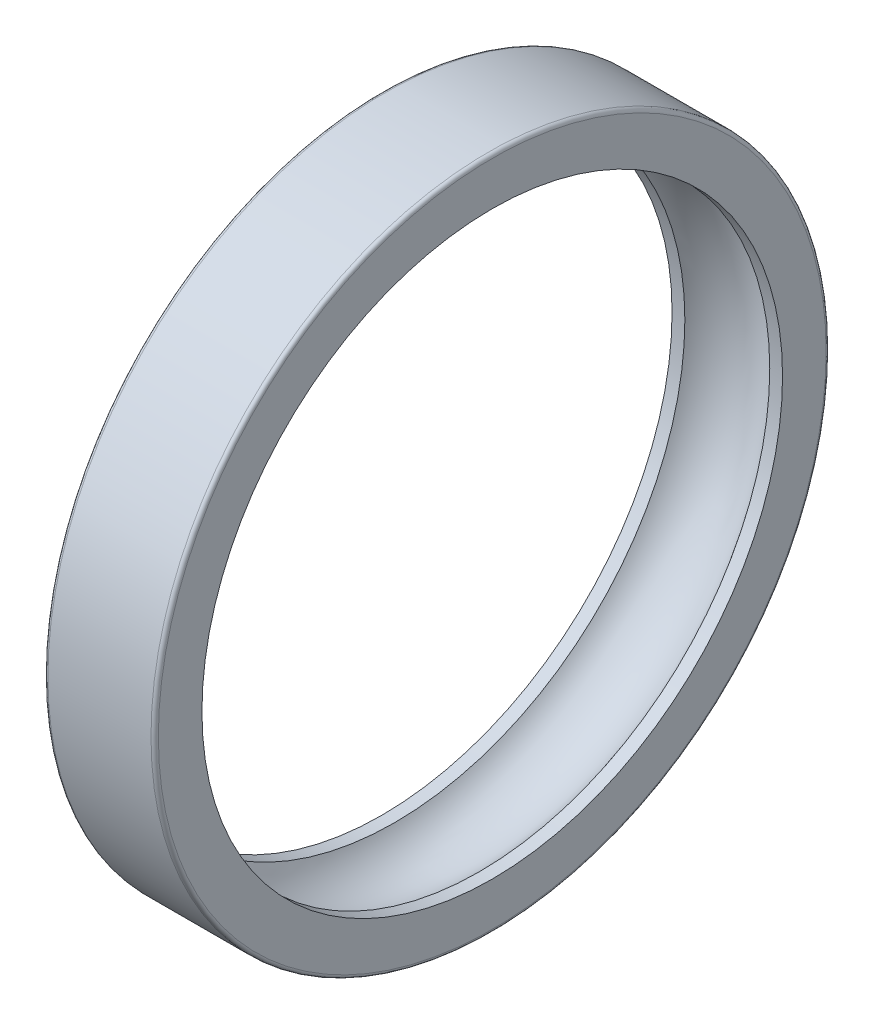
ISO-10303-21;
HEADER;
FILE_DESCRIPTION(('STEP AP214'),'2;1');
FILE_NAME('part.step','',(''),(''),'','','');
FILE_SCHEMA(('AUTOMOTIVE_DESIGN { 1 0 10303 214 1 1 1 1 }'));
ENDSEC;
DATA;
#1=APPLICATION_CONTEXT('core data for automotive mechanical design processes');
#2=APPLICATION_PROTOCOL_DEFINITION('international standard','automotive_design',2000,#1);
#3=PRODUCT_CONTEXT('',#1,'mechanical');
#4=PRODUCT('Part','Part','',(#3));
#5=PRODUCT_RELATED_PRODUCT_CATEGORY('part','',(#4));
#6=PRODUCT_DEFINITION_FORMATION('','',#4);
#7=PRODUCT_DEFINITION_CONTEXT('part definition',#1,'design');
#8=PRODUCT_DEFINITION('design','',#6,#7);
#9=PRODUCT_DEFINITION_SHAPE('','',#8);
#10=(LENGTH_UNIT() NAMED_UNIT(*) SI_UNIT(.MILLI.,.METRE.));
#11=(NAMED_UNIT(*) PLANE_ANGLE_UNIT() SI_UNIT($,.RADIAN.));
#12=(NAMED_UNIT(*) SI_UNIT($,.STERADIAN.) SOLID_ANGLE_UNIT());
#13=UNCERTAINTY_MEASURE_WITH_UNIT(LENGTH_MEASURE(1.E-05),#10,'distance_accuracy_value','');
#14=(GEOMETRIC_REPRESENTATION_CONTEXT(3) GLOBAL_UNCERTAINTY_ASSIGNED_CONTEXT((#13)) GLOBAL_UNIT_ASSIGNED_CONTEXT((#10,
#11,#12)) REPRESENTATION_CONTEXT('',''));
#15=CARTESIAN_POINT('',(0.,0.,0.));
#16=DIRECTION('',(0.,0.,1.));
#17=DIRECTION('',(1.,0.,0.));
#18=AXIS2_PLACEMENT_3D('',#15,#16,#17);
#19=CARTESIAN_POINT('',(0.,27.2,0.));
#20=DIRECTION('',(1.,0.,0.));
#21=DIRECTION('',(0.,0.,-1.));
#22=AXIS2_PLACEMENT_3D('',#19,#20,#21);
#23=PLANE('',#22);
#24=CARTESIAN_POINT('',(0.,0.,0.));
#25=DIRECTION('',(-1.,0.,0.));
#26=DIRECTION('',(0.,0.,1.));
#27=AXIS2_PLACEMENT_3D('',#24,#25,#26);
#28=CIRCLE('',#27,23.65);
#29=CARTESIAN_POINT('',(0.,0.,23.65));
#30=VERTEX_POINT('',#29);
#31=EDGE_CURVE('E9',#30,#30,#28,.T.);
#32=ORIENTED_EDGE('',*,*,#31,.F.);
#33=EDGE_LOOP('',(#32));
#34=FACE_BOUND('',#33,.T.);
#35=CARTESIAN_POINT('',(0.,0.,0.));
#36=DIRECTION('',(-1.,0.,0.));
#37=DIRECTION('',(0.,0.,1.));
#38=AXIS2_PLACEMENT_3D('',#35,#36,#37);
#39=CIRCLE('',#38,27.2);
#40=CARTESIAN_POINT('',(0.,0.,27.2));
#41=VERTEX_POINT('',#40);
#42=EDGE_CURVE('E41',#41,#41,#39,.T.);
#43=ORIENTED_EDGE('',*,*,#42,.T.);
#44=EDGE_LOOP('',(#43));
#45=FACE_BOUND('',#44,.T.);
#46=ADVANCED_FACE('F13',(#34,#45),#23,.F.);
#47=CARTESIAN_POINT('',(0.,0.,0.));
#48=DIRECTION('',(-1.,0.,0.));
#49=DIRECTION('',(0.,0.,1.));
#50=AXIS2_PLACEMENT_3D('',#47,#48,#49);
#51=CYLINDRICAL_SURFACE('',#50,23.65);
#52=CARTESIAN_POINT('',(1.04232938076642,0.,0.));
#53=DIRECTION('',(-1.,0.,0.));
#54=DIRECTION('',(0.,0.,1.));
#55=AXIS2_PLACEMENT_3D('',#52,#53,#54);
#56=CIRCLE('',#55,23.65);
#57=CARTESIAN_POINT('',(1.04232938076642,0.,23.65));
#58=VERTEX_POINT('',#57);
#59=EDGE_CURVE('E19',#58,#58,#56,.T.);
#60=ORIENTED_EDGE('',*,*,#59,.F.);
#61=EDGE_LOOP('',(#60));
#62=FACE_BOUND('',#61,.T.);
#63=ORIENTED_EDGE('',*,*,#31,.T.);
#64=EDGE_LOOP('',(#63));
#65=FACE_BOUND('',#64,.T.);
#66=ADVANCED_FACE('F78',(#62,#65),#51,.F.);
#67=CARTESIAN_POINT('',(4.5,0.,0.));
#68=DIRECTION('',(-1.,0.,0.));
#69=DIRECTION('',(0.,0.,1.));
#70=AXIS2_PLACEMENT_3D('',#67,#68,#69);
#71=TOROIDAL_SURFACE('',#70,21.325,4.16666666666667);
#72=ORIENTED_EDGE('',*,*,#59,.T.);
#73=EDGE_LOOP('',(#72));
#74=FACE_BOUND('',#73,.T.);
#75=CARTESIAN_POINT('',(7.95767061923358,0.,0.));
#76=DIRECTION('',(-1.,0.,0.));
#77=DIRECTION('',(0.,0.,1.));
#78=AXIS2_PLACEMENT_3D('',#75,#76,#77);
#79=CIRCLE('',#78,23.65);
#80=CARTESIAN_POINT('',(7.95767061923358,0.,23.65));
#81=VERTEX_POINT('',#80);
#82=EDGE_CURVE('E23',#81,#81,#79,.T.);
#83=ORIENTED_EDGE('',*,*,#82,.F.);
#84=EDGE_LOOP('',(#83));
#85=FACE_BOUND('',#84,.T.);
#86=ADVANCED_FACE('F73',(#74,#85),#71,.F.);
#87=CARTESIAN_POINT('',(0.,0.,0.));
#88=DIRECTION('',(-1.,0.,0.));
#89=DIRECTION('',(0.,0.,1.));
#90=AXIS2_PLACEMENT_3D('',#87,#88,#89);
#91=CYLINDRICAL_SURFACE('',#90,23.65);
#92=CARTESIAN_POINT('',(9.,0.,0.));
#93=DIRECTION('',(-1.,0.,0.));
#94=DIRECTION('',(0.,0.,1.));
#95=AXIS2_PLACEMENT_3D('',#92,#93,#94);
#96=CIRCLE('',#95,23.65);
#97=CARTESIAN_POINT('',(9.,0.,23.65));
#98=VERTEX_POINT('',#97);
#99=EDGE_CURVE('E27',#98,#98,#96,.T.);
#100=ORIENTED_EDGE('',*,*,#99,.F.);
#101=EDGE_LOOP('',(#100));
#102=FACE_BOUND('',#101,.T.);
#103=ORIENTED_EDGE('',*,*,#82,.T.);
#104=EDGE_LOOP('',(#103));
#105=FACE_BOUND('',#104,.T.);
#106=ADVANCED_FACE('F67',(#102,#105),#91,.F.);
#107=CARTESIAN_POINT('',(9.,23.65,0.));
#108=DIRECTION('',(-1.,0.,0.));
#109=DIRECTION('',(0.,0.,1.));
#110=AXIS2_PLACEMENT_3D('',#107,#108,#109);
#111=PLANE('',#110);
#112=CARTESIAN_POINT('',(9.,0.,0.));
#113=DIRECTION('',(-1.,0.,0.));
#114=DIRECTION('',(0.,0.,1.));
#115=AXIS2_PLACEMENT_3D('',#112,#113,#114);
#116=CIRCLE('',#115,27.2);
#117=CARTESIAN_POINT('',(9.,0.,27.2));
#118=VERTEX_POINT('',#117);
#119=EDGE_CURVE('E32',#118,#118,#116,.T.);
#120=ORIENTED_EDGE('',*,*,#119,.F.);
#121=EDGE_LOOP('',(#120));
#122=FACE_BOUND('',#121,.T.);
#123=ORIENTED_EDGE('',*,*,#99,.T.);
#124=EDGE_LOOP('',(#123));
#125=FACE_BOUND('',#124,.T.);
#126=ADVANCED_FACE('F61',(#122,#125),#111,.F.);
#127=CARTESIAN_POINT('',(8.7,0.,0.));
#128=DIRECTION('',(-1.,0.,0.));
#129=DIRECTION('',(0.,0.,1.));
#130=AXIS2_PLACEMENT_3D('',#127,#128,#129);
#131=TOROIDAL_SURFACE('',#130,27.2,0.3);
#132=CARTESIAN_POINT('',(8.7,0.,0.));
#133=DIRECTION('',(-1.,0.,0.));
#134=DIRECTION('',(0.,0.,1.));
#135=AXIS2_PLACEMENT_3D('',#132,#133,#134);
#136=CIRCLE('',#135,27.5);
#137=CARTESIAN_POINT('',(8.7,0.,27.5));
#138=VERTEX_POINT('',#137);
#139=EDGE_CURVE('E35',#138,#138,#136,.T.);
#140=ORIENTED_EDGE('',*,*,#139,.F.);
#141=EDGE_LOOP('',(#140));
#142=FACE_BOUND('',#141,.T.);
#143=ORIENTED_EDGE('',*,*,#119,.T.);
#144=EDGE_LOOP('',(#143));
#145=FACE_BOUND('',#144,.T.);
#146=ADVANCED_FACE('F55',(#142,#145),#131,.T.);
#147=CARTESIAN_POINT('',(0.,0.,0.));
#148=DIRECTION('',(-1.,0.,0.));
#149=DIRECTION('',(0.,0.,1.));
#150=AXIS2_PLACEMENT_3D('',#147,#148,#149);
#151=CYLINDRICAL_SURFACE('',#150,27.5);
#152=CARTESIAN_POINT('',(0.3,0.,0.));
#153=DIRECTION('',(-1.,0.,0.));
#154=DIRECTION('',(0.,0.,1.));
#155=AXIS2_PLACEMENT_3D('',#152,#153,#154);
#156=CIRCLE('',#155,27.5);
#157=CARTESIAN_POINT('',(0.3,0.,27.5));
#158=VERTEX_POINT('',#157);
#159=EDGE_CURVE('E38',#158,#158,#156,.T.);
#160=ORIENTED_EDGE('',*,*,#159,.F.);
#161=EDGE_LOOP('',(#160));
#162=FACE_BOUND('',#161,.T.);
#163=ORIENTED_EDGE('',*,*,#139,.T.);
#164=EDGE_LOOP('',(#163));
#165=FACE_BOUND('',#164,.T.);
#166=ADVANCED_FACE('F49',(#162,#165),#151,.T.);
#167=CARTESIAN_POINT('',(0.3,0.,0.));
#168=DIRECTION('',(-1.,0.,0.));
#169=DIRECTION('',(0.,0.,1.));
#170=AXIS2_PLACEMENT_3D('',#167,#168,#169);
#171=TOROIDAL_SURFACE('',#170,27.2,0.3);
#172=ORIENTED_EDGE('',*,*,#42,.F.);
#173=EDGE_LOOP('',(#172));
#174=FACE_BOUND('',#173,.T.);
#175=ORIENTED_EDGE('',*,*,#159,.T.);
#176=EDGE_LOOP('',(#175));
#177=FACE_BOUND('',#176,.T.);
#178=ADVANCED_FACE('F46',(#174,#177),#171,.T.);
#179=CLOSED_SHELL('',(#46,#66,#86,#106,#126,#146,#166,#178));
#180=MANIFOLD_SOLID_BREP('B1',#179);
#181=ADVANCED_BREP_SHAPE_REPRESENTATION('',(#18,#180),#14);
#182=SHAPE_DEFINITION_REPRESENTATION(#9,#181);
ENDSEC;
END-ISO-10303-21;
